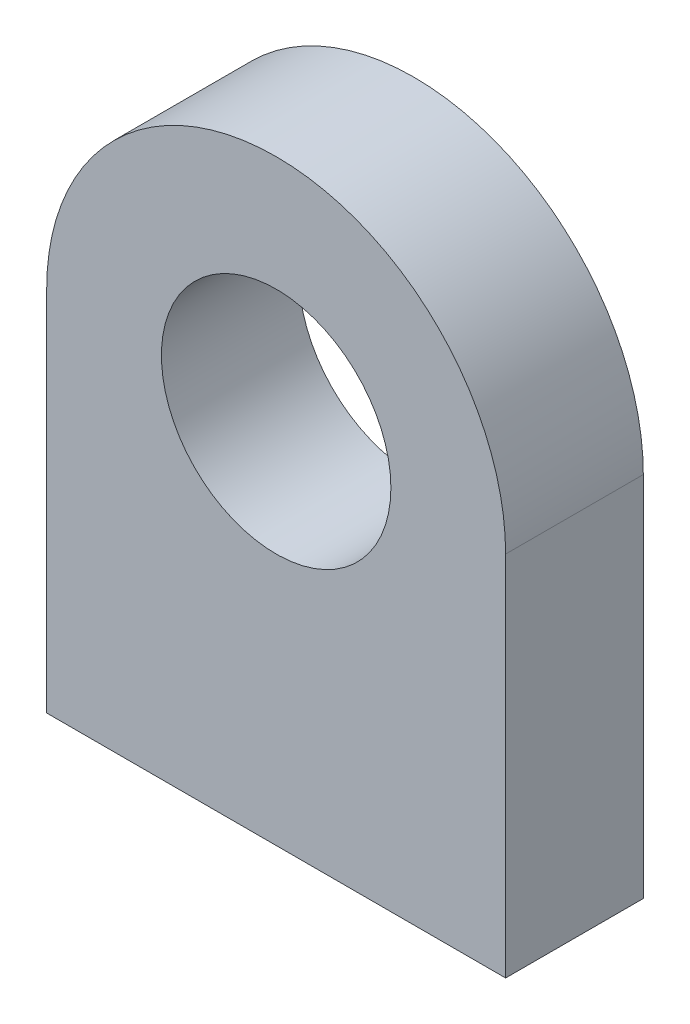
ISO-10303-21;
HEADER;
FILE_DESCRIPTION(('STEP AP214'),'2;1');
FILE_NAME('part.step','',(''),(''),'','','');
FILE_SCHEMA(('AUTOMOTIVE_DESIGN { 1 0 10303 214 1 1 1 1 }'));
ENDSEC;
DATA;
#1=APPLICATION_CONTEXT('core data for automotive mechanical design processes');
#2=APPLICATION_PROTOCOL_DEFINITION('international standard','automotive_design',2000,#1);
#3=PRODUCT_CONTEXT('',#1,'mechanical');
#4=PRODUCT('Part','Part','',(#3));
#5=PRODUCT_RELATED_PRODUCT_CATEGORY('part','',(#4));
#6=PRODUCT_DEFINITION_FORMATION('','',#4);
#7=PRODUCT_DEFINITION_CONTEXT('part definition',#1,'design');
#8=PRODUCT_DEFINITION('design','',#6,#7);
#9=PRODUCT_DEFINITION_SHAPE('','',#8);
#10=(LENGTH_UNIT() NAMED_UNIT(*) SI_UNIT(.MILLI.,.METRE.));
#11=(NAMED_UNIT(*) PLANE_ANGLE_UNIT() SI_UNIT($,.RADIAN.));
#12=(NAMED_UNIT(*) SI_UNIT($,.STERADIAN.) SOLID_ANGLE_UNIT());
#13=UNCERTAINTY_MEASURE_WITH_UNIT(LENGTH_MEASURE(1.E-05),#10,'distance_accuracy_value','');
#14=(GEOMETRIC_REPRESENTATION_CONTEXT(3) GLOBAL_UNCERTAINTY_ASSIGNED_CONTEXT((#13)) GLOBAL_UNIT_ASSIGNED_CONTEXT((#10,
#11,#12)) REPRESENTATION_CONTEXT('',''));
#15=CARTESIAN_POINT('',(0.,0.,0.));
#16=DIRECTION('',(0.,0.,1.));
#17=DIRECTION('',(1.,0.,0.));
#18=AXIS2_PLACEMENT_3D('',#15,#16,#17);
#19=CARTESIAN_POINT('',(0.,0.,30.));
#20=DIRECTION('',(0.,0.,-1.));
#21=DIRECTION('',(-1.,0.,0.));
#22=AXIS2_PLACEMENT_3D('',#19,#20,#21);
#23=PLANE('',#22);
#24=CARTESIAN_POINT('',(0.,0.,30.));
#25=DIRECTION('',(0.,0.,1.));
#26=DIRECTION('',(-1.,0.,0.));
#27=AXIS2_PLACEMENT_3D('',#24,#25,#26);
#28=CIRCLE('',#27,50.);
#29=CARTESIAN_POINT('',(50.,0.,30.));
#30=VERTEX_POINT('',#29);
#31=CARTESIAN_POINT('',(-50.,0.,30.));
#32=VERTEX_POINT('',#31);
#33=EDGE_CURVE('E83',#30,#32,#28,.T.);
#34=ORIENTED_EDGE('',*,*,#33,.T.);
#35=DIRECTION('',(0.,-1.,0.));
#36=VECTOR('',#35,1.);
#37=CARTESIAN_POINT('',(-50.,0.,30.));
#38=LINE('',#37,#36);
#39=CARTESIAN_POINT('',(-50.,-80.,30.));
#40=VERTEX_POINT('',#39);
#41=EDGE_CURVE('E78',#32,#40,#38,.T.);
#42=ORIENTED_EDGE('',*,*,#41,.T.);
#43=DIRECTION('',(1.,0.,0.));
#44=VECTOR('',#43,1.);
#45=CARTESIAN_POINT('',(-50.,-80.,30.));
#46=LINE('',#45,#44);
#47=CARTESIAN_POINT('',(50.,-80.,30.));
#48=VERTEX_POINT('',#47);
#49=EDGE_CURVE('E81',#40,#48,#46,.T.);
#50=ORIENTED_EDGE('',*,*,#49,.T.);
#51=DIRECTION('',(0.,1.,0.));
#52=VECTOR('',#51,1.);
#53=CARTESIAN_POINT('',(50.,-80.,30.));
#54=LINE('',#53,#52);
#55=EDGE_CURVE('E48',#48,#30,#54,.T.);
#56=ORIENTED_EDGE('',*,*,#55,.T.);
#57=EDGE_LOOP('',(#34,#42,#50,#56));
#58=FACE_BOUND('',#57,.T.);
#59=CARTESIAN_POINT('',(0.,0.,30.));
#60=DIRECTION('',(0.,0.,1.));
#61=DIRECTION('',(1.,0.,0.));
#62=AXIS2_PLACEMENT_3D('',#59,#60,#61);
#63=CIRCLE('',#62,25.);
#64=CARTESIAN_POINT('',(25.,0.,30.));
#65=VERTEX_POINT('',#64);
#66=EDGE_CURVE('E98',#65,#65,#63,.T.);
#67=ORIENTED_EDGE('',*,*,#66,.F.);
#68=EDGE_LOOP('',(#67));
#69=FACE_BOUND('',#68,.T.);
#70=ADVANCED_FACE('F31',(#58,#69),#23,.F.);
#71=CARTESIAN_POINT('',(0.,0.,0.));
#72=DIRECTION('',(0.,0.,-1.));
#73=DIRECTION('',(-1.,0.,0.));
#74=AXIS2_PLACEMENT_3D('',#71,#72,#73);
#75=PLANE('',#74);
#76=CARTESIAN_POINT('',(0.,0.,0.));
#77=DIRECTION('',(0.,0.,1.));
#78=DIRECTION('',(-1.,0.,0.));
#79=AXIS2_PLACEMENT_3D('',#76,#77,#78);
#80=CIRCLE('',#79,50.);
#81=CARTESIAN_POINT('',(50.,0.,0.));
#82=VERTEX_POINT('',#81);
#83=CARTESIAN_POINT('',(-50.,0.,0.));
#84=VERTEX_POINT('',#83);
#85=EDGE_CURVE('E95',#82,#84,#80,.T.);
#86=ORIENTED_EDGE('',*,*,#85,.F.);
#87=DIRECTION('',(0.,1.,0.));
#88=VECTOR('',#87,1.);
#89=CARTESIAN_POINT('',(50.,-80.,0.));
#90=LINE('',#89,#88);
#91=CARTESIAN_POINT('',(50.,-80.,0.));
#92=VERTEX_POINT('',#91);
#93=EDGE_CURVE('E71',#92,#82,#90,.T.);
#94=ORIENTED_EDGE('',*,*,#93,.F.);
#95=DIRECTION('',(1.,0.,0.));
#96=VECTOR('',#95,1.);
#97=CARTESIAN_POINT('',(-50.,-80.,0.));
#98=LINE('',#97,#96);
#99=CARTESIAN_POINT('',(-50.,-80.,0.));
#100=VERTEX_POINT('',#99);
#101=EDGE_CURVE('E65',#100,#92,#98,.T.);
#102=ORIENTED_EDGE('',*,*,#101,.F.);
#103=DIRECTION('',(0.,-1.,0.));
#104=VECTOR('',#103,1.);
#105=CARTESIAN_POINT('',(-50.,0.,0.));
#106=LINE('',#105,#104);
#107=EDGE_CURVE('E87',#84,#100,#106,.T.);
#108=ORIENTED_EDGE('',*,*,#107,.F.);
#109=EDGE_LOOP('',(#86,#94,#102,#108));
#110=FACE_BOUND('',#109,.T.);
#111=CARTESIAN_POINT('',(0.,0.,0.));
#112=DIRECTION('',(0.,0.,1.));
#113=DIRECTION('',(1.,0.,0.));
#114=AXIS2_PLACEMENT_3D('',#111,#112,#113);
#115=CIRCLE('',#114,25.);
#116=CARTESIAN_POINT('',(25.,0.,0.));
#117=VERTEX_POINT('',#116);
#118=EDGE_CURVE('E110',#117,#117,#115,.T.);
#119=ORIENTED_EDGE('',*,*,#118,.T.);
#120=EDGE_LOOP('',(#119));
#121=FACE_BOUND('',#120,.T.);
#122=ADVANCED_FACE('F106',(#110,#121),#75,.T.);
#123=CARTESIAN_POINT('',(0.,0.,30.));
#124=DIRECTION('',(0.,0.,-1.));
#125=DIRECTION('',(-1.,0.,0.));
#126=AXIS2_PLACEMENT_3D('',#123,#124,#125);
#127=CYLINDRICAL_SURFACE('',#126,50.);
#128=ORIENTED_EDGE('',*,*,#85,.T.);
#129=DIRECTION('',(0.,0.,-1.));
#130=VECTOR('',#129,1.);
#131=CARTESIAN_POINT('',(-50.,0.,30.));
#132=LINE('',#131,#130);
#133=EDGE_CURVE('E11',#32,#84,#132,.T.);
#134=ORIENTED_EDGE('',*,*,#133,.F.);
#135=ORIENTED_EDGE('',*,*,#33,.F.);
#136=DIRECTION('',(0.,0.,-1.));
#137=VECTOR('',#136,1.);
#138=CARTESIAN_POINT('',(50.,0.,30.));
#139=LINE('',#138,#137);
#140=EDGE_CURVE('E91',#30,#82,#139,.T.);
#141=ORIENTED_EDGE('',*,*,#140,.T.);
#142=EDGE_LOOP('',(#128,#134,#135,#141));
#143=FACE_BOUND('',#142,.T.);
#144=ADVANCED_FACE('F33',(#143),#127,.T.);
#145=CARTESIAN_POINT('',(-50.,0.,30.));
#146=DIRECTION('',(1.,0.,0.));
#147=DIRECTION('',(0.,1.,0.));
#148=AXIS2_PLACEMENT_3D('',#145,#146,#147);
#149=PLANE('',#148);
#150=ORIENTED_EDGE('',*,*,#107,.T.);
#151=DIRECTION('',(0.,0.,-1.));
#152=VECTOR('',#151,1.);
#153=CARTESIAN_POINT('',(-50.,-80.,30.));
#154=LINE('',#153,#152);
#155=EDGE_CURVE('E40',#40,#100,#154,.T.);
#156=ORIENTED_EDGE('',*,*,#155,.F.);
#157=ORIENTED_EDGE('',*,*,#41,.F.);
#158=ORIENTED_EDGE('',*,*,#133,.T.);
#159=EDGE_LOOP('',(#150,#156,#157,#158));
#160=FACE_BOUND('',#159,.T.);
#161=ADVANCED_FACE('F86',(#160),#149,.F.);
#162=CARTESIAN_POINT('',(-50.,-80.,30.));
#163=DIRECTION('',(0.,1.,0.));
#164=DIRECTION('',(-1.,0.,0.));
#165=AXIS2_PLACEMENT_3D('',#162,#163,#164);
#166=PLANE('',#165);
#167=ORIENTED_EDGE('',*,*,#101,.T.);
#168=DIRECTION('',(0.,0.,-1.));
#169=VECTOR('',#168,1.);
#170=CARTESIAN_POINT('',(50.,-80.,30.));
#171=LINE('',#170,#169);
#172=EDGE_CURVE('E88',#48,#92,#171,.T.);
#173=ORIENTED_EDGE('',*,*,#172,.F.);
#174=ORIENTED_EDGE('',*,*,#49,.F.);
#175=ORIENTED_EDGE('',*,*,#155,.T.);
#176=EDGE_LOOP('',(#167,#173,#174,#175));
#177=FACE_BOUND('',#176,.T.);
#178=ADVANCED_FACE('F89',(#177),#166,.F.);
#179=CARTESIAN_POINT('',(50.,-80.,30.));
#180=DIRECTION('',(-1.,0.,0.));
#181=DIRECTION('',(0.,-1.,0.));
#182=AXIS2_PLACEMENT_3D('',#179,#180,#181);
#183=PLANE('',#182);
#184=ORIENTED_EDGE('',*,*,#93,.T.);
#185=ORIENTED_EDGE('',*,*,#140,.F.);
#186=ORIENTED_EDGE('',*,*,#55,.F.);
#187=ORIENTED_EDGE('',*,*,#172,.T.);
#188=EDGE_LOOP('',(#184,#185,#186,#187));
#189=FACE_BOUND('',#188,.T.);
#190=ADVANCED_FACE('F103',(#189),#183,.F.);
#191=CARTESIAN_POINT('',(0.,0.,30.));
#192=DIRECTION('',(0.,0.,-1.));
#193=DIRECTION('',(-1.,0.,0.));
#194=AXIS2_PLACEMENT_3D('',#191,#192,#193);
#195=CYLINDRICAL_SURFACE('',#194,25.);
#196=ORIENTED_EDGE('',*,*,#66,.T.);
#197=EDGE_LOOP('',(#196));
#198=FACE_BOUND('',#197,.T.);
#199=ORIENTED_EDGE('',*,*,#118,.F.);
#200=EDGE_LOOP('',(#199));
#201=FACE_BOUND('',#200,.T.);
#202=ADVANCED_FACE('F116',(#198,#201),#195,.F.);
#203=CLOSED_SHELL('',(#70,#122,#144,#161,#178,#190,#202));
#204=MANIFOLD_SOLID_BREP('B2',#203);
#205=ADVANCED_BREP_SHAPE_REPRESENTATION('',(#18,#204),#14);
#206=SHAPE_DEFINITION_REPRESENTATION(#9,#205);
ENDSEC;
END-ISO-10303-21;
